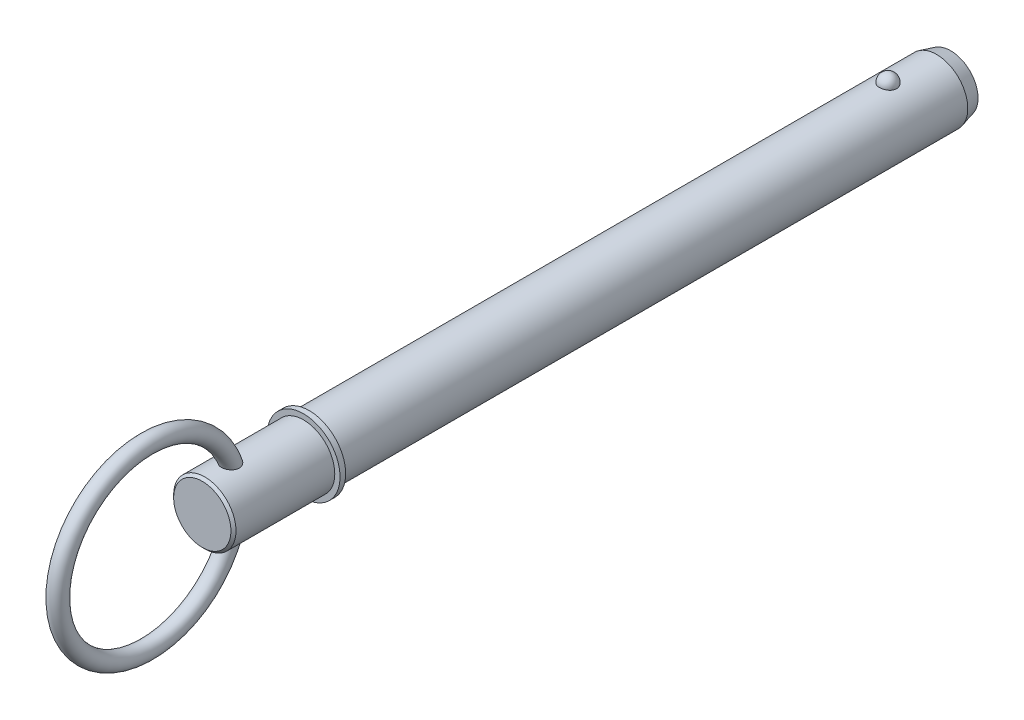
ISO-10303-21;
HEADER;
FILE_DESCRIPTION(('STEP AP214'),'2;1');
FILE_NAME('part.step','',(''),(''),'','','');
FILE_SCHEMA(('AUTOMOTIVE_DESIGN { 1 0 10303 214 1 1 1 1 }'));
ENDSEC;
DATA;
#1=APPLICATION_CONTEXT('core data for automotive mechanical design processes');
#2=APPLICATION_PROTOCOL_DEFINITION('international standard','automotive_design',2000,#1);
#3=PRODUCT_CONTEXT('',#1,'mechanical');
#4=PRODUCT('Part','Part','',(#3));
#5=PRODUCT_RELATED_PRODUCT_CATEGORY('part','',(#4));
#6=PRODUCT_DEFINITION_FORMATION('','',#4);
#7=PRODUCT_DEFINITION_CONTEXT('part definition',#1,'design');
#8=PRODUCT_DEFINITION('design','',#6,#7);
#9=PRODUCT_DEFINITION_SHAPE('','',#8);
#10=(LENGTH_UNIT() NAMED_UNIT(*) SI_UNIT(.MILLI.,.METRE.));
#11=(NAMED_UNIT(*) PLANE_ANGLE_UNIT() SI_UNIT($,.RADIAN.));
#12=(NAMED_UNIT(*) SI_UNIT($,.STERADIAN.) SOLID_ANGLE_UNIT());
#13=UNCERTAINTY_MEASURE_WITH_UNIT(LENGTH_MEASURE(1.E-05),#10,'distance_accuracy_value','');
#14=(GEOMETRIC_REPRESENTATION_CONTEXT(3) GLOBAL_UNCERTAINTY_ASSIGNED_CONTEXT((#13)) GLOBAL_UNIT_ASSIGNED_CONTEXT((#10,
#11,#12)) REPRESENTATION_CONTEXT('',''));
#15=CARTESIAN_POINT('',(0.,0.,0.));
#16=DIRECTION('',(0.,0.,1.));
#17=DIRECTION('',(1.,0.,0.));
#18=AXIS2_PLACEMENT_3D('',#15,#16,#17);
#19=CARTESIAN_POINT('',(0.,0.,203.2));
#20=DIRECTION('',(0.,0.,-1.));
#21=DIRECTION('',(-1.,0.,0.));
#22=AXIS2_PLACEMENT_3D('',#19,#20,#21);
#23=CYLINDRICAL_SURFACE('',#22,11.115);
#24=CARTESIAN_POINT('',(3.04058343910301,10.6910278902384,-3.06999999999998));
#25=CARTESIAN_POINT('',(3.04058039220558,10.6910304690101,-2.89837124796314));
#26=CARTESIAN_POINT('',(3.02657193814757,10.6950430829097,-2.72670368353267));
#27=CARTESIAN_POINT('',(2.97087341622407,10.7106465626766,-2.38822964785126));
#28=CARTESIAN_POINT('',(2.92917240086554,10.7222404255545,-2.22142512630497));
#29=CARTESIAN_POINT('',(2.81915317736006,10.751689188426,-1.89750816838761));
#30=CARTESIAN_POINT('',(2.75084669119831,10.7695413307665,-1.74039149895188));
#31=CARTESIAN_POINT('',(2.58932284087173,10.809510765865,-1.4401395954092));
#32=CARTESIAN_POINT('',(2.49610617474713,10.8316279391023,-1.29700396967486));
#33=CARTESIAN_POINT('',(2.28659317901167,10.877786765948,-1.02797591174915));
#34=CARTESIAN_POINT('',(2.17018825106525,10.9018371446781,-0.902169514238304));
#35=CARTESIAN_POINT('',(1.91759004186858,10.9490888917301,-0.672091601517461));
#36=CARTESIAN_POINT('',(1.78139672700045,10.9722902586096,-0.567820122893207));
#37=CARTESIAN_POINT('',(1.49327884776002,11.0151925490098,-0.38399276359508));
#38=CARTESIAN_POINT('',(1.34139928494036,11.034903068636,-0.304368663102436));
#39=CARTESIAN_POINT('',(1.02584823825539,11.0686948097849,-0.171731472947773));
#40=CARTESIAN_POINT('',(0.86217801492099,11.0827766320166,-0.118715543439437));
#41=CARTESIAN_POINT('',(0.530748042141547,11.1035404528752,-0.041530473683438));
#42=CARTESIAN_POINT('',(0.363109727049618,11.1103474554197,-0.0168734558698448));
#43=CARTESIAN_POINT('',(0.0259327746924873,11.1162480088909,0.00453486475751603));
#44=CARTESIAN_POINT('',(-0.143605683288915,11.1153422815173,0.00128877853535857));
#45=CARTESIAN_POINT('',(-0.477280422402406,11.1059854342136,-0.0327676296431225));
#46=CARTESIAN_POINT('',(-0.641459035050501,11.0976393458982,-0.0631942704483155));
#47=CARTESIAN_POINT('',(-0.962236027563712,11.0744390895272,-0.150220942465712));
#48=CARTESIAN_POINT('',(-1.11883427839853,11.0595848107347,-0.206821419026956));
#49=CARTESIAN_POINT('',(-1.4210461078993,11.0248420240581,-0.345028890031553));
#50=CARTESIAN_POINT('',(-1.56659244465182,11.0049254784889,-0.426775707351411));
#51=CARTESIAN_POINT('',(-1.84189316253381,10.9622119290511,-0.612956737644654));
#52=CARTESIAN_POINT('',(-1.97164597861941,10.9394146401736,-0.717393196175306));
#53=CARTESIAN_POINT('',(-2.21432263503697,10.8929139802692,-0.948332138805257));
#54=CARTESIAN_POINT('',(-2.3268890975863,10.8692016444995,-1.07520847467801));
#55=CARTESIAN_POINT('',(-2.52940007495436,10.8238699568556,-1.34622145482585));
#56=CARTESIAN_POINT('',(-2.6193430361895,10.8022507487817,-1.49035928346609));
#57=CARTESIAN_POINT('',(-2.77523958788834,10.7632629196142,-1.79367507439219));
#58=CARTESIAN_POINT('',(-2.8409151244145,10.7459442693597,-1.95300253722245));
#59=CARTESIAN_POINT('',(-2.94519180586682,10.7178360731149,-2.28083009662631));
#60=CARTESIAN_POINT('',(-2.98379371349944,10.707046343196,-2.44932993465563));
#61=CARTESIAN_POINT('',(-3.03284665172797,10.6932559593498,-2.78998091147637));
#62=CARTESIAN_POINT('',(-3.04341313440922,10.6902233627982,-2.96211412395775));
#63=CARTESIAN_POINT('',(-3.03646037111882,10.6922002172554,-3.30576225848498));
#64=CARTESIAN_POINT('',(-3.0189418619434,10.6972094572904,-3.47727719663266));
#65=CARTESIAN_POINT('',(-2.95641582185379,10.7146564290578,-3.81396465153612));
#66=CARTESIAN_POINT('',(-2.91154117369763,10.7270582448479,-3.97916375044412));
#67=CARTESIAN_POINT('',(-2.79553341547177,10.7578713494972,-4.29947360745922));
#68=CARTESIAN_POINT('',(-2.72439927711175,10.7762828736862,-4.45458397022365));
#69=CARTESIAN_POINT('',(-2.55718900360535,10.8171819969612,-4.75123550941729));
#70=CARTESIAN_POINT('',(-2.46098224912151,10.8396907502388,-4.89270014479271));
#71=CARTESIAN_POINT('',(-2.24623042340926,10.8862165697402,-5.15724095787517));
#72=CARTESIAN_POINT('',(-2.12768452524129,10.9102336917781,-5.28031645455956));
#73=CARTESIAN_POINT('',(-1.87085107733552,10.9571990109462,-5.50509615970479));
#74=CARTESIAN_POINT('',(-1.73249451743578,10.9801430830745,-5.6067224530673));
#75=CARTESIAN_POINT('',(-1.44010079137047,11.0223008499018,-5.78517789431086));
#76=CARTESIAN_POINT('',(-1.28606470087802,11.0415148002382,-5.86200874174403));
#77=CARTESIAN_POINT('',(-0.968615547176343,11.0738491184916,-5.98788441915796));
#78=CARTESIAN_POINT('',(-0.805339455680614,11.0870408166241,-6.0372561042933));
#79=CARTESIAN_POINT('',(-0.47244987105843,11.1062048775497,-6.10820004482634));
#80=CARTESIAN_POINT('',(-0.302837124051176,11.11217808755,-6.12977556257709));
#81=CARTESIAN_POINT('',(0.0345765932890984,11.1162034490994,-6.14436196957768));
#82=CARTESIAN_POINT('',(0.20235372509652,11.1143988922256,-6.13788957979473));
#83=CARTESIAN_POINT('',(0.534364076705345,11.103390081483,-6.0977398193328));
#84=CARTESIAN_POINT('',(0.698597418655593,11.094186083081,-6.06406338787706));
#85=CARTESIAN_POINT('',(1.01830314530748,11.0694136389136,-5.97063285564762));
#86=CARTESIAN_POINT('',(1.17380497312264,11.0538682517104,-5.91097318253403));
#87=CARTESIAN_POINT('',(1.472484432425,11.0180608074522,-5.76723645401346));
#88=CARTESIAN_POINT('',(1.6156613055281,10.9977984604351,-5.68315789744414));
#89=CARTESIAN_POINT('',(1.88801614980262,10.9543574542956,-5.49138807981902));
#90=CARTESIAN_POINT('',(2.01695079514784,10.9311394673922,-5.38336024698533));
#91=CARTESIAN_POINT('',(2.25501495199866,10.8845248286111,-5.14733839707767));
#92=CARTESIAN_POINT('',(2.36414099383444,10.8611281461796,-5.01934088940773));
#93=CARTESIAN_POINT('',(2.56152595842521,10.8162958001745,-4.7444793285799));
#94=CARTESIAN_POINT('',(2.64940088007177,10.7948999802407,-4.59733288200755));
#95=CARTESIAN_POINT('',(2.79961494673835,10.7569242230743,-4.29001203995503));
#96=CARTESIAN_POINT('',(2.86196390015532,10.7403424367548,-4.12984267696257));
#97=CARTESIAN_POINT('',(2.95377333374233,10.715429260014,-3.82062342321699));
#98=CARTESIAN_POINT('',(2.98627018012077,10.7063495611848,-3.67252681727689));
#99=CARTESIAN_POINT('',(3.02967634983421,10.6941478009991,-3.37296350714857));
#100=CARTESIAN_POINT('',(3.04058612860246,10.6910256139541,-3.22149687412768));
#101=CARTESIAN_POINT('',(3.04058343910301,10.6910278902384,-3.06999999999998));
#102=B_SPLINE_CURVE_WITH_KNOTS('',3,(#24,#25,#26,#27,#28,#29,#30,#31,#32,#33,#34,#35,#36,#37,
#38,#39,#40,#41,#42,#43,#44,#45,#46,#47,#48,#49,#50,#51,#52,#53,#54,#55,#56,#57,#58,#59,#60,#61,
#62,#63,#64,#65,#66,#67,#68,#69,#70,#71,#72,#73,#74,#75,#76,#77,#78,#79,#80,#81,#82,#83,#84,#85,
#86,#87,#88,#89,#90,#91,#92,#93,#94,#95,#96,#97,#98,#99,#100,#101),.UNSPECIFIED.,.T.,.F.,(4,2,2,
2,2,2,2,2,2,2,2,2,2,2,2,2,2,2,2,2,2,2,2,2,2,2,2,2,2,2,2,2,2,2,2,2,2,2,4),(0.,0.514341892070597,
1.02888723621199,1.54320613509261,2.0575106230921,2.57428293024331,3.09105611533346,
3.60638589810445,4.1216606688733,4.62793159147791,5.1341551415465,5.63334381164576,
6.13254097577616,6.63456562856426,7.13663998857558,7.64804063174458,8.15947638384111,
8.6766026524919,9.19371435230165,9.70869321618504,10.223658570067,10.7361421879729,
11.2486458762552,11.7638748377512,12.2791228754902,12.7962115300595,13.3132647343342,
13.8240238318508,14.3347229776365,14.8360540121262,15.3373677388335,15.8368746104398,
16.3364121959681,16.8434736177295,17.3506237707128,17.8663484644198,18.3818748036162,
18.8358944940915,19.2899046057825),.UNSPECIFIED.);
#103=CARTESIAN_POINT('',(3.04058343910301,10.6910278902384,-3.06999999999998));
#104=VERTEX_POINT('',#103);
#105=EDGE_CURVE('E102',#104,#104,#102,.T.);
#106=ORIENTED_EDGE('',*,*,#105,.T.);
#107=EDGE_LOOP('',(#106));
#108=FACE_BOUND('',#107,.T.);
#109=CARTESIAN_POINT('',(0.,0.,-20.4));
#110=DIRECTION('',(0.,0.,-1.));
#111=DIRECTION('',(-1.,0.,0.));
#112=AXIS2_PLACEMENT_3D('',#109,#110,#111);
#113=CIRCLE('',#112,11.115);
#114=CARTESIAN_POINT('',(-11.115,0.,-20.4));
#115=VERTEX_POINT('',#114);
#116=EDGE_CURVE('E110',#115,#115,#113,.F.);
#117=ORIENTED_EDGE('',*,*,#116,.T.);
#118=EDGE_LOOP('',(#117));
#119=FACE_BOUND('',#118,.T.);
#120=CARTESIAN_POINT('',(0.,0.,203.2));
#121=DIRECTION('',(0.,0.,1.));
#122=DIRECTION('',(1.,0.,0.));
#123=AXIS2_PLACEMENT_3D('',#120,#121,#122);
#124=CIRCLE('',#123,11.115);
#125=CARTESIAN_POINT('',(11.115,0.,203.2));
#126=VERTEX_POINT('',#125);
#127=EDGE_CURVE('E108',#126,#126,#124,.T.);
#128=ORIENTED_EDGE('',*,*,#127,.F.);
#129=EDGE_LOOP('',(#128));
#130=FACE_BOUND('',#129,.T.);
#131=ADVANCED_FACE('F39',(#108,#119,#130),#23,.T.);
#132=CARTESIAN_POINT('',(0.,0.,-25.4));
#133=DIRECTION('',(0.,0.,-1.));
#134=DIRECTION('',(-1.,0.,0.));
#135=AXIS2_PLACEMENT_3D('',#132,#133,#134);
#136=PLANE('',#135);
#137=CARTESIAN_POINT('',(0.,0.,-25.4));
#138=DIRECTION('',(0.,0.,-1.));
#139=DIRECTION('',(-1.,0.,0.));
#140=AXIS2_PLACEMENT_3D('',#137,#138,#139);
#141=CIRCLE('',#140,9.77525403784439);
#142=CARTESIAN_POINT('',(-9.77525403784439,0.,-25.4));
#143=VERTEX_POINT('',#142);
#144=EDGE_CURVE('E142',#143,#143,#141,.T.);
#145=ORIENTED_EDGE('',*,*,#144,.T.);
#146=EDGE_LOOP('',(#145));
#147=FACE_BOUND('',#146,.T.);
#148=ADVANCED_FACE('F88',(#147),#136,.T.);
#149=CARTESIAN_POINT('',(0.,0.,-25.4));
#150=DIRECTION('',(0.,0.,1.));
#151=DIRECTION('',(1.,0.,0.));
#152=AXIS2_PLACEMENT_3D('',#149,#150,#151);
#153=CONICAL_SURFACE('',#152,9.77525403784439,0.261799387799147);
#154=ORIENTED_EDGE('',*,*,#116,.F.);
#155=EDGE_LOOP('',(#154));
#156=FACE_BOUND('',#155,.T.);
#157=ORIENTED_EDGE('',*,*,#144,.F.);
#158=EDGE_LOOP('',(#157));
#159=FACE_BOUND('',#158,.T.);
#160=ADVANCED_FACE('F94',(#156,#159),#153,.T.);
#161=CARTESIAN_POINT('',(0.,11.115,-3.06999999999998));
#162=DIRECTION('',(0.,1.,0.));
#163=DIRECTION('',(0.,0.,1.));
#164=AXIS2_PLACEMENT_3D('',#161,#162,#163);
#165=SPHERICAL_SURFACE('',#164,3.07);
#166=ORIENTED_EDGE('',*,*,#105,.F.);
#167=EDGE_LOOP('',(#166));
#168=FACE_BOUND('',#167,.T.);
#169=ADVANCED_FACE('F113',(#168),#165,.T.);
#170=CARTESIAN_POINT('',(0.,0.,203.2));
#171=DIRECTION('',(0.,0.,-1.));
#172=DIRECTION('',(-1.,0.,0.));
#173=AXIS2_PLACEMENT_3D('',#170,#171,#172);
#174=PLANE('',#173);
#175=ORIENTED_EDGE('',*,*,#127,.T.);
#176=EDGE_LOOP('',(#175));
#177=FACE_BOUND('',#176,.T.);
#178=CARTESIAN_POINT('',(0.,0.,203.2));
#179=DIRECTION('',(0.,0.,-1.));
#180=DIRECTION('',(-1.,0.,0.));
#181=AXIS2_PLACEMENT_3D('',#178,#179,#180);
#182=CIRCLE('',#181,13.);
#183=CARTESIAN_POINT('',(-13.,0.,203.2));
#184=VERTEX_POINT('',#183);
#185=EDGE_CURVE('E109',#184,#184,#182,.T.);
#186=ORIENTED_EDGE('',*,*,#185,.T.);
#187=EDGE_LOOP('',(#186));
#188=FACE_BOUND('',#187,.T.);
#189=ADVANCED_FACE('F117',(#177,#188),#174,.T.);
#190=CARTESIAN_POINT('',(0.,0.,33.7287874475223));
#191=DIRECTION('',(0.,0.,-1.));
#192=DIRECTION('',(-1.,0.,0.));
#193=AXIS2_PLACEMENT_3D('',#190,#191,#192);
#194=CYLINDRICAL_SURFACE('',#193,13.);
#195=CARTESIAN_POINT('',(0.,0.,205.2));
#196=DIRECTION('',(0.,0.,-1.));
#197=DIRECTION('',(-1.,0.,0.));
#198=AXIS2_PLACEMENT_3D('',#195,#196,#197);
#199=CIRCLE('',#198,13.);
#200=CARTESIAN_POINT('',(-13.,0.,205.2));
#201=VERTEX_POINT('',#200);
#202=EDGE_CURVE('E134',#201,#201,#199,.T.);
#203=ORIENTED_EDGE('',*,*,#202,.T.);
#204=EDGE_LOOP('',(#203));
#205=FACE_BOUND('',#204,.T.);
#206=ORIENTED_EDGE('',*,*,#185,.F.);
#207=EDGE_LOOP('',(#206));
#208=FACE_BOUND('',#207,.T.);
#209=ADVANCED_FACE('F121',(#205,#208),#194,.T.);
#210=CARTESIAN_POINT('',(0.,13.,205.2));
#211=DIRECTION('',(0.,0.,1.));
#212=DIRECTION('',(1.,0.,0.));
#213=AXIS2_PLACEMENT_3D('',#210,#211,#212);
#214=PLANE('',#213);
#215=CARTESIAN_POINT('',(0.,0.,205.2));
#216=DIRECTION('',(0.,0.,1.));
#217=DIRECTION('',(1.,0.,0.));
#218=AXIS2_PLACEMENT_3D('',#215,#216,#217);
#219=CIRCLE('',#218,11.115);
#220=CARTESIAN_POINT('',(11.115,0.,205.2));
#221=VERTEX_POINT('',#220);
#222=EDGE_CURVE('E112',#221,#221,#219,.T.);
#223=ORIENTED_EDGE('',*,*,#222,.F.);
#224=EDGE_LOOP('',(#223));
#225=FACE_BOUND('',#224,.T.);
#226=ORIENTED_EDGE('',*,*,#202,.F.);
#227=EDGE_LOOP('',(#226));
#228=FACE_BOUND('',#227,.T.);
#229=ADVANCED_FACE('F85',(#225,#228),#214,.T.);
#230=CARTESIAN_POINT('',(0.,0.,241.3));
#231=DIRECTION('',(0.,0.,-1.));
#232=DIRECTION('',(-1.,0.,0.));
#233=AXIS2_PLACEMENT_3D('',#230,#231,#232);
#234=CYLINDRICAL_SURFACE('',#233,11.115);
#235=CARTESIAN_POINT('',(-1.22435852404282,-11.0473603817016,228.378419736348));
#236=CARTESIAN_POINT('',(-1.0707801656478,-11.0643805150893,228.311699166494));
#237=CARTESIAN_POINT('',(-0.911372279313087,-11.0787777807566,228.257745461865));
#238=CARTESIAN_POINT('',(-0.585451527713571,-11.1007717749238,228.176552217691));
#239=CARTESIAN_POINT('',(-0.418938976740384,-11.1083688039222,228.149311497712));
#240=CARTESIAN_POINT('',(-0.0835394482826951,-11.1159515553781,228.122121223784));
#241=CARTESIAN_POINT('',(0.0853474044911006,-11.1159376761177,228.122170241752));
#242=CARTESIAN_POINT('',(0.420723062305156,-11.1083011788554,228.149554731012));
#243=CARTESIAN_POINT('',(0.587211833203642,-11.1006784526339,228.176890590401));
#244=CARTESIAN_POINT('',(0.913189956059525,-11.0786293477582,228.25829957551));
#245=CARTESIAN_POINT('',(1.07267378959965,-11.0641977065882,228.312393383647));
#246=CARTESIAN_POINT('',(1.37994044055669,-11.0300907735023,228.446140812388));
#247=CARTESIAN_POINT('',(1.52772335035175,-11.0104155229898,228.525794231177));
#248=CARTESIAN_POINT('',(1.80679367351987,-10.9680716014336,228.708467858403));
#249=CARTESIAN_POINT('',(1.93814041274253,-10.945414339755,228.811400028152));
#250=CARTESIAN_POINT('',(2.18117403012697,-10.8995884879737,229.038212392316));
#251=CARTESIAN_POINT('',(2.29286356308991,-10.8764199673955,229.162089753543));
#252=CARTESIAN_POINT('',(2.49238969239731,-10.8324319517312,229.425992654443));
#253=CARTESIAN_POINT('',(2.58046870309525,-10.8115899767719,229.565831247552));
#254=CARTESIAN_POINT('',(2.73218762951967,-10.7742522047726,229.858691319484));
#255=CARTESIAN_POINT('',(2.7958294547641,-10.757756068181,230.011711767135));
#256=CARTESIAN_POINT('',(2.89767977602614,-10.7307723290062,230.3266092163));
#257=CARTESIAN_POINT('',(2.93586554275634,-10.7202900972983,230.488493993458));
#258=CARTESIAN_POINT('',(2.98678800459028,-10.7062139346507,230.816480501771));
#259=CARTESIAN_POINT('',(2.99951894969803,-10.7026215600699,230.982583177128));
#260=CARTESIAN_POINT('',(3.0004780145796,-10.7023530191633,231.323227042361));
#261=CARTESIAN_POINT('',(2.98743421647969,-10.7060358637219,231.497770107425));
#262=CARTESIAN_POINT('',(2.93592917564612,-10.7202719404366,231.842750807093));
#263=CARTESIAN_POINT('',(2.8974582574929,-10.7308277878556,232.013186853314));
#264=CARTESIAN_POINT('',(2.79180512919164,-10.7588257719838,232.363114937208));
#265=CARTESIAN_POINT('',(2.72213928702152,-10.776850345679,232.541811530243));
#266=CARTESIAN_POINT('',(2.5561284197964,-10.8174264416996,232.885974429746));
#267=CARTESIAN_POINT('',(2.4597569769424,-10.8399824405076,233.051427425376));
#268=CARTESIAN_POINT('',(2.23434632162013,-10.8887625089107,233.375672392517));
#269=CARTESIAN_POINT('',(2.10349593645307,-10.9151327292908,233.533192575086));
#270=CARTESIAN_POINT('',(1.81505097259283,-10.96677510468,233.821668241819));
#271=CARTESIAN_POINT('',(1.65749731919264,-10.9920488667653,233.95266371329));
#272=CARTESIAN_POINT('',(1.36197799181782,-11.0319737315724,234.151313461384));
#273=CARTESIAN_POINT('',(1.22927684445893,-11.0476896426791,234.22660092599));
#274=CARTESIAN_POINT('',(0.952979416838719,-11.0749380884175,234.354574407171));
#275=CARTESIAN_POINT('',(0.809393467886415,-11.0864745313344,234.40728154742));
#276=CARTESIAN_POINT('',(0.513954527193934,-11.1041011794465,234.487058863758));
#277=CARTESIAN_POINT('',(0.362058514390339,-11.1101594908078,234.513978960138));
#278=CARTESIAN_POINT('',(0.0557792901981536,-11.1159132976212,234.539559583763));
#279=CARTESIAN_POINT('',(-0.0986030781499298,-11.1156109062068,234.538229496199));
#280=CARTESIAN_POINT('',(-0.389768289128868,-11.1090283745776,234.508935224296));
#281=CARTESIAN_POINT('',(-0.526830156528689,-11.1033186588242,234.483512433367));
#282=CARTESIAN_POINT('',(-0.794878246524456,-11.0873547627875,234.411270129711));
#283=CARTESIAN_POINT('',(-0.925863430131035,-11.0770998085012,234.364446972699));
#284=CARTESIAN_POINT('',(-1.18354406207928,-11.0525934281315,234.249843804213));
#285=CARTESIAN_POINT('',(-1.30991621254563,-11.0382116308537,234.181371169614));
#286=CARTESIAN_POINT('',(-1.55122352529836,-11.0068962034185,234.027131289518));
#287=CARTESIAN_POINT('',(-1.66615377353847,-10.9899614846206,233.941356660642));
#288=CARTESIAN_POINT('',(-1.90024050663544,-10.9520991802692,233.74087205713));
#289=CARTESIAN_POINT('',(-2.01728342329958,-10.9309598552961,233.623737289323));
#290=CARTESIAN_POINT('',(-2.23333659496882,-10.8888735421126,233.373839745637));
#291=CARTESIAN_POINT('',(-2.33233396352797,-10.8679267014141,233.241065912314));
#292=CARTESIAN_POINT('',(-2.52607041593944,-10.8246766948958,232.940000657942));
#293=CARTESIAN_POINT('',(-2.61741570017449,-10.8027194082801,232.769462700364));
#294=CARTESIAN_POINT('',(-2.77251687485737,-10.7639568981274,232.415671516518));
#295=CARTESIAN_POINT('',(-2.83625783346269,-10.7471544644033,232.232411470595));
#296=CARTESIAN_POINT('',(-2.93668505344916,-10.7201706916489,231.846624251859));
#297=CARTESIAN_POINT('',(-2.97161961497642,-10.7104219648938,231.643594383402));
#298=CARTESIAN_POINT('',(-2.99683495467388,-10.7033740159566,231.336874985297));
#299=CARTESIAN_POINT('',(-3.00070536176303,-10.7022882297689,231.234234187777));
#300=CARTESIAN_POINT('',(-2.99908594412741,-10.7027439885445,231.029049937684));
#301=CARTESIAN_POINT('',(-2.99360154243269,-10.7042840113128,230.926506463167));
#302=CARTESIAN_POINT('',(-2.97382504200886,-10.7097936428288,230.730330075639));
#303=CARTESIAN_POINT('',(-2.96024395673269,-10.7135669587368,230.636619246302));
#304=CARTESIAN_POINT('',(-2.92480741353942,-10.723295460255,230.450932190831));
#305=CARTESIAN_POINT('',(-2.90295619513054,-10.7292495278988,230.35895510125));
#306=CARTESIAN_POINT('',(-2.8509700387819,-10.7431800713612,230.177547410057));
#307=CARTESIAN_POINT('',(-2.82083748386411,-10.7511559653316,230.088116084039));
#308=CARTESIAN_POINT('',(-2.75241691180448,-10.7688750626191,229.91264532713));
#309=CARTESIAN_POINT('',(-2.71412954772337,-10.7786181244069,229.82660562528));
#310=CARTESIAN_POINT('',(-2.59550576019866,-10.807996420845,229.591055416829));
#311=CARTESIAN_POINT('',(-2.50612224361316,-10.8292837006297,229.446173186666));
#312=CARTESIAN_POINT('',(-2.30366035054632,-10.8741467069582,229.174571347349));
#313=CARTESIAN_POINT('',(-2.19058370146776,-10.8977222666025,229.047850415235));
#314=CARTESIAN_POINT('',(-1.94442412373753,-10.9443154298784,228.816462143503));
#315=CARTESIAN_POINT('',(-1.81141354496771,-10.967334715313,228.71171820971));
#316=CARTESIAN_POINT('',(-1.52904284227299,-11.0102504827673,228.526435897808));
#317=CARTESIAN_POINT('',(-1.3796820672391,-11.0301468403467,228.445898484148));
#318=CARTESIAN_POINT('',(-1.22435852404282,-11.0473603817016,228.378419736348));
#319=B_SPLINE_CURVE_WITH_KNOTS('',3,(#235,#236,#237,#238,#239,#240,#241,#242,#243,#244,#245,
#246,#247,#248,#249,#250,#251,#252,#253,#254,#255,#256,#257,#258,#259,#260,#261,#262,#263,#264,
#265,#266,#267,#268,#269,#270,#271,#272,#273,#274,#275,#276,#277,#278,#279,#280,#281,#282,#283,
#284,#285,#286,#287,#288,#289,#290,#291,#292,#293,#294,#295,#296,#297,#298,#299,#300,#301,#302,
#303,#304,#305,#306,#307,#308,#309,#310,#311,#312,#313,#314,#315,#316,#317,#318),.UNSPECIFIED.,
.T.,.F.,(4,2,2,2,2,2,2,2,2,2,2,2,2,2,2,2,2,2,2,2,2,2,2,2,2,2,2,2,2,2,2,2,2,2,2,2,2,2,2,2,2,4),
(0.,0.504317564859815,1.00861284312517,1.51288173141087,2.01715779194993,2.52182424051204,
3.02648670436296,3.52927157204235,4.03198848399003,4.52932690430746,5.02662645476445,
5.52436944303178,6.02222485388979,6.545261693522,7.0684976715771,7.64398785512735,
8.22004937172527,8.83633461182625,9.45168373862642,9.90997173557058,10.3678300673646,
10.8283372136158,11.2886913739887,11.7053264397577,12.1220324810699,12.5537129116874,
12.9855779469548,13.4844842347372,13.9837454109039,14.5653303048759,15.1472294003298,
15.762338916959,16.0701226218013,16.3777279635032,16.6616380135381,16.9454027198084,
17.229085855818,17.5127462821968,18.0246262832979,18.5364689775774,19.0464970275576,
19.556545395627),.UNSPECIFIED.);
#320=CARTESIAN_POINT('',(-1.22435852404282,-11.0473603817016,228.378419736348));
#321=VERTEX_POINT('',#320);
#322=EDGE_CURVE('E10',#321,#321,#319,.T.);
#323=ORIENTED_EDGE('',*,*,#322,.F.);
#324=EDGE_LOOP('',(#323));
#325=FACE_BOUND('',#324,.T.);
#326=CARTESIAN_POINT('',(-1.22435852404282,11.0473603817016,228.378419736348));
#327=CARTESIAN_POINT('',(-1.3763077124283,11.0305212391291,228.444431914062));
#328=CARTESIAN_POINT('',(-1.52254325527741,11.0111158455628,228.522938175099));
#329=CARTESIAN_POINT('',(-1.7994538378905,10.9692671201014,228.70315338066));
#330=CARTESIAN_POINT('',(-1.9301301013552,10.9468240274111,228.804860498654));
#331=CARTESIAN_POINT('',(-2.17227655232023,10.9013603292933,229.029035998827));
#332=CARTESIAN_POINT('',(-2.28373752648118,10.8783394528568,229.151514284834));
#333=CARTESIAN_POINT('',(-2.48427458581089,10.8343057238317,229.413895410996));
#334=CARTESIAN_POINT('',(-2.57335330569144,10.8132926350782,229.553796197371));
#335=CARTESIAN_POINT('',(-2.72640074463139,10.7757209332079,229.845964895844));
#336=CARTESIAN_POINT('',(-2.79054231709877,10.7591319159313,229.99813851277));
#337=CARTESIAN_POINT('',(-2.89354234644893,10.7318913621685,230.311286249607));
#338=CARTESIAN_POINT('',(-2.93239912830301,10.7212402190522,230.472260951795));
#339=CARTESIAN_POINT('',(-2.98540436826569,10.7066038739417,230.801955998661));
#340=CARTESIAN_POINT('',(-2.9990165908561,10.7027634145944,230.970768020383));
#341=CARTESIAN_POINT('',(-3.00088147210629,10.7022388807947,231.308508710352));
#342=CARTESIAN_POINT('',(-2.98912652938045,10.7055569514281,231.477437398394));
#343=CARTESIAN_POINT('',(-2.93985175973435,10.7191979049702,231.824856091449));
#344=CARTESIAN_POINT('',(-2.90036626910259,10.7300544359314,232.003044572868));
#345=CARTESIAN_POINT('',(-2.79555002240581,10.7578360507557,232.351215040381));
#346=CARTESIAN_POINT('',(-2.73019988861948,10.774765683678,232.521190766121));
#347=CARTESIAN_POINT('',(-2.56762574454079,10.8147227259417,232.865784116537));
#348=CARTESIAN_POINT('',(-2.46786230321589,10.838191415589,233.039157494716));
#349=CARTESIAN_POINT('',(-2.24100420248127,10.8873575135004,233.366686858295));
#350=CARTESIAN_POINT('',(-2.11391925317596,10.9130541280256,233.520849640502));
#351=CARTESIAN_POINT('',(-1.85542700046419,10.9597063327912,233.782735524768));
#352=CARTESIAN_POINT('',(-1.72758345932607,10.9807909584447,233.893955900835));
#353=CARTESIAN_POINT('',(-1.45489931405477,11.0202250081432,234.09412236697));
#354=CARTESIAN_POINT('',(-1.31006770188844,11.0385758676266,234.183080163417));
#355=CARTESIAN_POINT('',(-1.08171164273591,11.0625084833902,234.2963702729));
#356=CARTESIAN_POINT('',(-1.00332234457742,11.069914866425,234.330896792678));
#357=CARTESIAN_POINT('',(-0.843525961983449,11.0832350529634,234.392391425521));
#358=CARTESIAN_POINT('',(-0.762120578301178,11.0891496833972,234.419363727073));
#359=CARTESIAN_POINT('',(-0.597014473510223,11.0992628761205,234.46518193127));
#360=CARTESIAN_POINT('',(-0.513315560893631,11.1034627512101,234.484034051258));
#361=CARTESIAN_POINT('',(-0.344374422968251,11.1099851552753,234.513209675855));
#362=CARTESIAN_POINT('',(-0.259132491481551,11.1123080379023,234.523534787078));
#363=CARTESIAN_POINT('',(-0.10083895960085,11.114780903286,234.534519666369));
#364=CARTESIAN_POINT('',(-0.0278735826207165,11.1152042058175,234.536395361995));
#365=CARTESIAN_POINT('',(0.117962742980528,11.1146132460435,234.533773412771));
#366=CARTESIAN_POINT('',(0.190833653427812,11.1135985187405,234.529273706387));
#367=CARTESIAN_POINT('',(0.335842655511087,11.110161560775,234.513978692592));
#368=CARTESIAN_POINT('',(0.407981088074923,11.1077400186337,234.503186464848));
#369=CARTESIAN_POINT('',(0.551029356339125,11.1015643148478,234.475503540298));
#370=CARTESIAN_POINT('',(0.621938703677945,11.0978096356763,234.458610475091));
#371=CARTESIAN_POINT('',(0.825381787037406,11.0851145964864,234.401054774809));
#372=CARTESIAN_POINT('',(0.955713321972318,11.0745538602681,234.352705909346));
#373=CARTESIAN_POINT('',(1.20733127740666,11.0499605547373,234.237325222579));
#374=CARTESIAN_POINT('',(1.32861527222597,11.0359270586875,234.170288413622));
#375=CARTESIAN_POINT('',(1.57344360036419,11.0038352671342,234.011843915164));
#376=CARTESIAN_POINT('',(1.69572941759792,10.9855025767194,233.918551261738));
#377=CARTESIAN_POINT('',(1.9256521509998,10.9475431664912,233.715650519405));
#378=CARTESIAN_POINT('',(2.03328016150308,10.9279156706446,233.606032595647));
#379=CARTESIAN_POINT('',(2.25048911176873,10.8854412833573,233.35299112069));
#380=CARTESIAN_POINT('',(2.35710396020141,10.8626332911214,233.207010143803));
#381=CARTESIAN_POINT('',(2.54757318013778,10.8195493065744,232.900478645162));
#382=CARTESIAN_POINT('',(2.63141052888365,10.799275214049,232.739917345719));
#383=CARTESIAN_POINT('',(2.78342312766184,10.7611645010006,232.387827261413));
#384=CARTESIAN_POINT('',(2.84851472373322,10.7439117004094,232.194893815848));
#385=CARTESIAN_POINT('',(2.94562652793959,10.7177011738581,231.800130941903));
#386=CARTESIAN_POINT('',(2.97764942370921,10.7087427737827,231.59830223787));
#387=CARTESIAN_POINT('',(2.99864828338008,10.7028651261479,231.295989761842));
#388=CARTESIAN_POINT('',(3.00125529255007,10.7021342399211,231.196378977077));
#389=CARTESIAN_POINT('',(2.9976304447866,10.7031517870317,230.997345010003));
#390=CARTESIAN_POINT('',(2.99140295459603,10.704898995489,230.897921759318));
#391=CARTESIAN_POINT('',(2.96990080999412,10.710883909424,230.700179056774));
#392=CARTESIAN_POINT('',(2.95463019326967,10.7151205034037,230.601859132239));
#393=CARTESIAN_POINT('',(2.91493260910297,10.7259879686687,230.407219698));
#394=CARTESIAN_POINT('',(2.89050674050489,10.7326185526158,230.310899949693));
#395=CARTESIAN_POINT('',(2.83556656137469,10.7472556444,230.131222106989));
#396=CARTESIAN_POINT('',(2.80596337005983,10.7550439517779,230.047566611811));
#397=CARTESIAN_POINT('',(2.73953102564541,10.7721572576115,229.883300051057));
#398=CARTESIAN_POINT('',(2.7026993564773,10.7814827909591,229.802690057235));
#399=CARTESIAN_POINT('',(2.6220344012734,10.801383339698,229.645273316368));
#400=CARTESIAN_POINT('',(2.57820565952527,10.8119575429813,229.568464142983));
#401=CARTESIAN_POINT('',(2.48382482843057,10.8340293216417,229.419223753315));
#402=CARTESIAN_POINT('',(2.4332703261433,10.8455272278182,229.346794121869));
#403=CARTESIAN_POINT('',(2.27895739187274,10.879345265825,229.145992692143));
#404=CARTESIAN_POINT('',(2.16717186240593,10.9023791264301,229.023764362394));
#405=CARTESIAN_POINT('',(1.92442677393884,10.9478318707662,228.800151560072));
#406=CARTESIAN_POINT('',(1.7934683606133,10.9702507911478,228.698765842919));
#407=CARTESIAN_POINT('',(1.51657151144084,11.0119360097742,228.519564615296));
#408=CARTESIAN_POINT('',(1.37069187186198,11.0312139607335,228.441661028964));
#409=CARTESIAN_POINT('',(1.06764402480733,11.0646548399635,228.310680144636));
#410=CARTESIAN_POINT('',(0.91047533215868,11.0788175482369,228.257603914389));
#411=CARTESIAN_POINT('',(0.587492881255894,11.1006548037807,228.17697871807));
#412=CARTESIAN_POINT('',(0.421604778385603,11.1082585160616,228.149708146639));
#413=CARTESIAN_POINT('',(0.0874262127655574,11.1159127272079,228.122259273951));
#414=CARTESIAN_POINT('',(-0.0808643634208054,11.1159628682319,228.12208225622));
#415=CARTESIAN_POINT('',(-0.416252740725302,11.1084780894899,228.148918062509));
#416=CARTESIAN_POINT('',(-0.583334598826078,11.1008914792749,228.176116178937));
#417=CARTESIAN_POINT('',(-0.910355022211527,11.0788693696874,228.257401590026));
#418=CARTESIAN_POINT('',(-1.07029370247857,11.064433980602,228.311488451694));
#419=CARTESIAN_POINT('',(-1.22435852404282,11.0473603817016,228.378419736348));
#420=B_SPLINE_CURVE_WITH_KNOTS('',3,(#326,#327,#328,#329,#330,#331,#332,#333,#334,#335,#336,
#337,#338,#339,#340,#341,#342,#343,#344,#345,#346,#347,#348,#349,#350,#351,#352,#353,#354,#355,
#356,#357,#358,#359,#360,#361,#362,#363,#364,#365,#366,#367,#368,#369,#370,#371,#372,#373,#374,
#375,#376,#377,#378,#379,#380,#381,#382,#383,#384,#385,#386,#387,#388,#389,#390,#391,#392,#393,
#394,#395,#396,#397,#398,#399,#400,#401,#402,#403,#404,#405,#406,#407,#408,#409,#410,#411,#412,
#413,#414,#415,#416,#417,#418,#419),.UNSPECIFIED.,.T.,.F.,(4,2,2,2,2,2,2,2,2,2,2,2,2,2,2,2,2,2,
2,2,2,2,2,2,2,2,2,2,2,2,2,2,2,2,2,2,2,2,2,2,2,2,2,2,2,2,4),(0.,0.498977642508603,
0.997916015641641,1.49709295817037,1.99621111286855,2.49180514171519,2.98743199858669,
3.49347125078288,3.99966216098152,4.54591839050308,5.09258465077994,5.69407889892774,
6.29535972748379,6.80565832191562,7.31568801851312,7.57328514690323,7.83073916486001,
8.08799570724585,8.34520376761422,8.56389164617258,8.78265025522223,9.00130188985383,
9.22003849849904,9.63638938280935,10.0528514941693,10.5157946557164,10.9790178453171,
11.5234572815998,12.0683024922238,12.6784825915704,13.288613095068,13.5872082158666,
13.8856557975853,14.1839702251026,14.482248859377,14.7491407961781,15.016125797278,
15.2829381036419,15.5498463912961,16.0489312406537,16.5479862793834,17.0451454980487,
17.5423260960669,18.0448111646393,18.5473200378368,19.0532532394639,19.5591782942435),.UNSPECIFIED.);
#421=CARTESIAN_POINT('',(-1.22435852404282,11.0473603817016,228.378419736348));
#422=VERTEX_POINT('',#421);
#423=EDGE_CURVE('E51',#422,#422,#420,.T.);
#424=ORIENTED_EDGE('',*,*,#423,.F.);
#425=EDGE_LOOP('',(#424));
#426=FACE_BOUND('',#425,.T.);
#427=CARTESIAN_POINT('',(0.,0.,240.4));
#428=DIRECTION('',(0.,0.,-1.));
#429=DIRECTION('',(-1.,0.,0.));
#430=AXIS2_PLACEMENT_3D('',#427,#428,#429);
#431=CIRCLE('',#430,11.115);
#432=CARTESIAN_POINT('',(-11.115,0.,240.4));
#433=VERTEX_POINT('',#432);
#434=EDGE_CURVE('E64',#433,#433,#431,.T.);
#435=ORIENTED_EDGE('',*,*,#434,.T.);
#436=EDGE_LOOP('',(#435));
#437=FACE_BOUND('',#436,.T.);
#438=ORIENTED_EDGE('',*,*,#222,.T.);
#439=EDGE_LOOP('',(#438));
#440=FACE_BOUND('',#439,.T.);
#441=ADVANCED_FACE('F69',(#325,#426,#437,#440),#234,.T.);
#442=CARTESIAN_POINT('',(0.,0.,241.3));
#443=DIRECTION('',(0.,0.,-1.));
#444=DIRECTION('',(-1.,0.,0.));
#445=AXIS2_PLACEMENT_3D('',#442,#443,#444);
#446=PLANE('',#445);
#447=CARTESIAN_POINT('',(0.,0.,241.3));
#448=DIRECTION('',(0.,0.,-1.));
#449=DIRECTION('',(-1.,0.,0.));
#450=AXIS2_PLACEMENT_3D('',#447,#448,#449);
#451=CIRCLE('',#450,10.2149999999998);
#452=CARTESIAN_POINT('',(-10.2149999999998,0.,241.3));
#453=VERTEX_POINT('',#452);
#454=EDGE_CURVE('E58',#453,#453,#451,.F.);
#455=ORIENTED_EDGE('',*,*,#454,.T.);
#456=EDGE_LOOP('',(#455));
#457=FACE_BOUND('',#456,.T.);
#458=ADVANCED_FACE('F76',(#457),#446,.F.);
#459=CARTESIAN_POINT('',(0.,0.,240.4));
#460=DIRECTION('',(0.,0.,-1.));
#461=DIRECTION('',(-1.,0.,0.));
#462=AXIS2_PLACEMENT_3D('',#459,#460,#461);
#463=CONICAL_SURFACE('',#462,11.115,0.785398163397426);
#464=ORIENTED_EDGE('',*,*,#454,.F.);
#465=EDGE_LOOP('',(#464));
#466=FACE_BOUND('',#465,.T.);
#467=ORIENTED_EDGE('',*,*,#434,.F.);
#468=EDGE_LOOP('',(#467));
#469=FACE_BOUND('',#468,.T.);
#470=ADVANCED_FACE('F41',(#466,#469),#463,.T.);
#471=CARTESIAN_POINT('',(0.,0.,261.05));
#472=DIRECTION('',(1.,0.,0.));
#473=DIRECTION('',(0.,0.,-1.));
#474=AXIS2_PLACEMENT_3D('',#471,#472,#473);
#475=TOROIDAL_SURFACE('',#474,31.75,3.);
#476=ORIENTED_EDGE('',*,*,#322,.T.);
#477=EDGE_LOOP('',(#476));
#478=FACE_BOUND('',#477,.T.);
#479=ORIENTED_EDGE('',*,*,#423,.T.);
#480=EDGE_LOOP('',(#479));
#481=FACE_BOUND('',#480,.T.);
#482=ADVANCED_FACE('F73',(#478,#481),#475,.T.);
#483=CLOSED_SHELL('',(#131,#148,#160,#169,#189,#209,#229,#441,#458,#470,#482));
#484=MANIFOLD_SOLID_BREP('B2',#483);
#485=ADVANCED_BREP_SHAPE_REPRESENTATION('',(#18,#484),#14);
#486=SHAPE_DEFINITION_REPRESENTATION(#9,#485);
ENDSEC;
END-ISO-10303-21;
